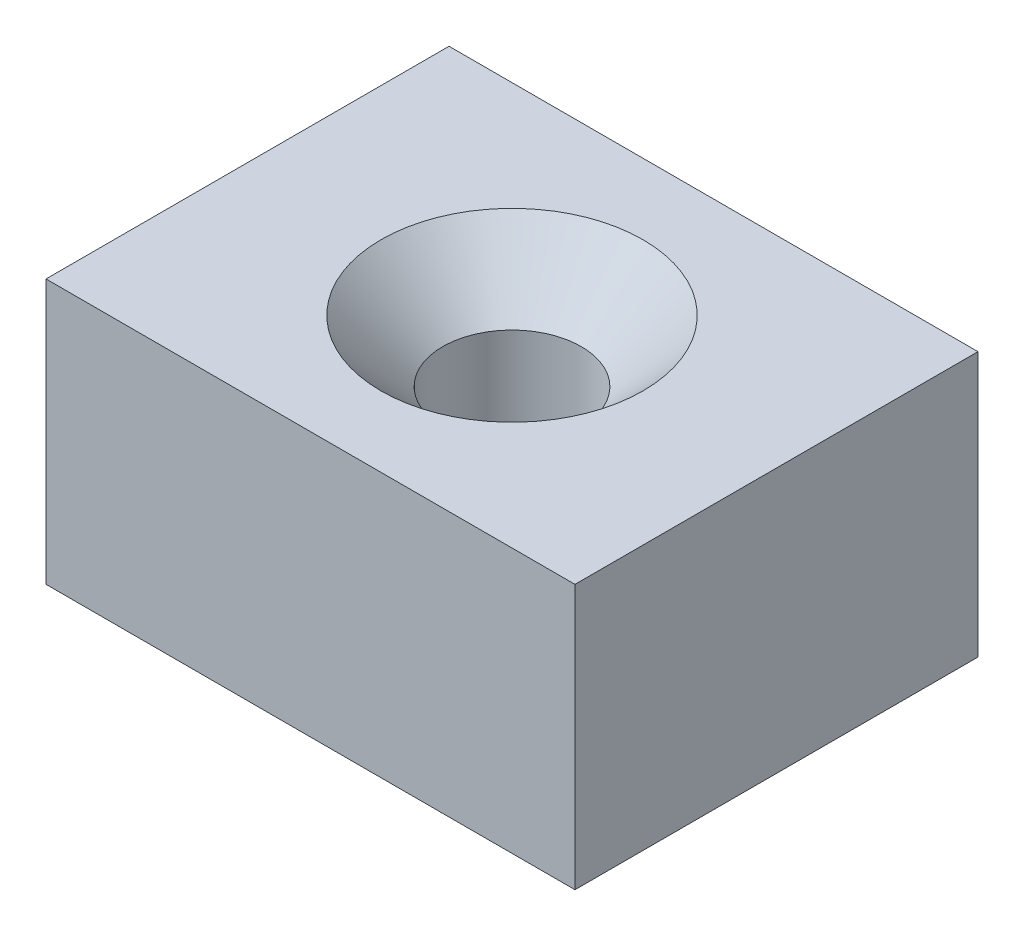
ISO-10303-21;
HEADER;
FILE_DESCRIPTION(('STEP AP214'),'2;1');
FILE_NAME('part.step','',(''),(''),'','','');
FILE_SCHEMA(('AUTOMOTIVE_DESIGN { 1 0 10303 214 1 1 1 1 }'));
ENDSEC;
DATA;
#1=APPLICATION_CONTEXT('core data for automotive mechanical design processes');
#2=APPLICATION_PROTOCOL_DEFINITION('international standard','automotive_design',2000,#1);
#3=PRODUCT_CONTEXT('',#1,'mechanical');
#4=PRODUCT('Part','Part','',(#3));
#5=PRODUCT_RELATED_PRODUCT_CATEGORY('part','',(#4));
#6=PRODUCT_DEFINITION_FORMATION('','',#4);
#7=PRODUCT_DEFINITION_CONTEXT('part definition',#1,'design');
#8=PRODUCT_DEFINITION('design','',#6,#7);
#9=PRODUCT_DEFINITION_SHAPE('','',#8);
#10=(LENGTH_UNIT() NAMED_UNIT(*) SI_UNIT(.MILLI.,.METRE.));
#11=(NAMED_UNIT(*) PLANE_ANGLE_UNIT() SI_UNIT($,.RADIAN.));
#12=(NAMED_UNIT(*) SI_UNIT($,.STERADIAN.) SOLID_ANGLE_UNIT());
#13=UNCERTAINTY_MEASURE_WITH_UNIT(LENGTH_MEASURE(1.E-05),#10,'distance_accuracy_value','');
#14=(GEOMETRIC_REPRESENTATION_CONTEXT(3) GLOBAL_UNCERTAINTY_ASSIGNED_CONTEXT((#13)) GLOBAL_UNIT_ASSIGNED_CONTEXT((#10,
#11,#12)) REPRESENTATION_CONTEXT('',''));
#15=CARTESIAN_POINT('',(0.,0.,0.));
#16=DIRECTION('',(0.,0.,1.));
#17=DIRECTION('',(1.,0.,0.));
#18=AXIS2_PLACEMENT_3D('',#15,#16,#17);
#19=CARTESIAN_POINT('',(10.5,5.25000000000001,16.));
#20=DIRECTION('',(-1.,0.,0.));
#21=DIRECTION('',(0.,-1.,0.));
#22=AXIS2_PLACEMENT_3D('',#19,#20,#21);
#23=PLANE('',#22);
#24=DIRECTION('',(0.,1.,0.));
#25=VECTOR('',#24,1.);
#26=CARTESIAN_POINT('',(10.5,5.25000000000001,0.));
#27=LINE('',#26,#25);
#28=CARTESIAN_POINT('',(10.5,-5.25,0.));
#29=VERTEX_POINT('',#28);
#30=CARTESIAN_POINT('',(10.5,5.25000000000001,0.));
#31=VERTEX_POINT('',#30);
#32=EDGE_CURVE('E95',#29,#31,#27,.T.);
#33=ORIENTED_EDGE('',*,*,#32,.T.);
#34=DIRECTION('',(0.,0.,-1.));
#35=VECTOR('',#34,1.);
#36=CARTESIAN_POINT('',(10.5,5.25000000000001,16.));
#37=LINE('',#36,#35);
#38=CARTESIAN_POINT('',(10.5,5.25000000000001,16.));
#39=VERTEX_POINT('',#38);
#40=EDGE_CURVE('E11',#39,#31,#37,.T.);
#41=ORIENTED_EDGE('',*,*,#40,.F.);
#42=DIRECTION('',(0.,1.,0.));
#43=VECTOR('',#42,1.);
#44=CARTESIAN_POINT('',(10.5,5.25000000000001,16.));
#45=LINE('',#44,#43);
#46=CARTESIAN_POINT('',(10.5,-5.25,16.));
#47=VERTEX_POINT('',#46);
#48=EDGE_CURVE('E83',#47,#39,#45,.T.);
#49=ORIENTED_EDGE('',*,*,#48,.F.);
#50=DIRECTION('',(0.,0.,-1.));
#51=VECTOR('',#50,1.);
#52=CARTESIAN_POINT('',(10.5,-5.25,16.));
#53=LINE('',#52,#51);
#54=EDGE_CURVE('E91',#47,#29,#53,.T.);
#55=ORIENTED_EDGE('',*,*,#54,.T.);
#56=EDGE_LOOP('',(#33,#41,#49,#55));
#57=FACE_BOUND('',#56,.T.);
#58=ADVANCED_FACE('F32',(#57),#23,.F.);
#59=CARTESIAN_POINT('',(-10.5,5.25000000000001,16.));
#60=DIRECTION('',(0.,-1.,0.));
#61=DIRECTION('',(0.,0.,-1.));
#62=AXIS2_PLACEMENT_3D('',#59,#60,#61);
#63=PLANE('',#62);
#64=CARTESIAN_POINT('',(0.,5.25000000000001,8.));
#65=DIRECTION('',(0.,1.,0.));
#66=DIRECTION('',(0.,0.,1.));
#67=AXIS2_PLACEMENT_3D('',#64,#65,#66);
#68=CIRCLE('',#67,5.2);
#69=CARTESIAN_POINT('',(0.,5.25000000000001,13.2));
#70=VERTEX_POINT('',#69);
#71=EDGE_CURVE('E114',#70,#70,#68,.T.);
#72=ORIENTED_EDGE('',*,*,#71,.F.);
#73=EDGE_LOOP('',(#72));
#74=FACE_BOUND('',#73,.T.);
#75=DIRECTION('',(-1.,0.,0.));
#76=VECTOR('',#75,1.);
#77=CARTESIAN_POINT('',(-10.5,5.25000000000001,0.));
#78=LINE('',#77,#76);
#79=CARTESIAN_POINT('',(-10.5,5.25000000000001,0.));
#80=VERTEX_POINT('',#79);
#81=EDGE_CURVE('E87',#31,#80,#78,.T.);
#82=ORIENTED_EDGE('',*,*,#81,.T.);
#83=DIRECTION('',(0.,0.,-1.));
#84=VECTOR('',#83,1.);
#85=CARTESIAN_POINT('',(-10.5,5.25000000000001,16.));
#86=LINE('',#85,#84);
#87=CARTESIAN_POINT('',(-10.5,5.25000000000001,16.));
#88=VERTEX_POINT('',#87);
#89=EDGE_CURVE('E40',#88,#80,#86,.T.);
#90=ORIENTED_EDGE('',*,*,#89,.F.);
#91=DIRECTION('',(-1.,0.,0.));
#92=VECTOR('',#91,1.);
#93=CARTESIAN_POINT('',(-10.5,5.25000000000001,16.));
#94=LINE('',#93,#92);
#95=EDGE_CURVE('E78',#39,#88,#94,.T.);
#96=ORIENTED_EDGE('',*,*,#95,.F.);
#97=ORIENTED_EDGE('',*,*,#40,.T.);
#98=EDGE_LOOP('',(#82,#90,#96,#97));
#99=FACE_BOUND('',#98,.T.);
#100=ADVANCED_FACE('F86',(#74,#99),#63,.F.);
#101=CARTESIAN_POINT('',(-10.5,5.25000000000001,16.));
#102=DIRECTION('',(1.,0.,0.));
#103=DIRECTION('',(0.,1.,0.));
#104=AXIS2_PLACEMENT_3D('',#101,#102,#103);
#105=PLANE('',#104);
#106=DIRECTION('',(0.,-1.,0.));
#107=VECTOR('',#106,1.);
#108=CARTESIAN_POINT('',(-10.5,5.25000000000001,0.));
#109=LINE('',#108,#107);
#110=CARTESIAN_POINT('',(-10.5,-5.25,0.));
#111=VERTEX_POINT('',#110);
#112=EDGE_CURVE('E65',#80,#111,#109,.T.);
#113=ORIENTED_EDGE('',*,*,#112,.T.);
#114=DIRECTION('',(0.,0.,-1.));
#115=VECTOR('',#114,1.);
#116=CARTESIAN_POINT('',(-10.5,-5.25,16.));
#117=LINE('',#116,#115);
#118=CARTESIAN_POINT('',(-10.5,-5.25,16.));
#119=VERTEX_POINT('',#118);
#120=EDGE_CURVE('E88',#119,#111,#117,.T.);
#121=ORIENTED_EDGE('',*,*,#120,.F.);
#122=DIRECTION('',(0.,-1.,0.));
#123=VECTOR('',#122,1.);
#124=CARTESIAN_POINT('',(-10.5,5.25000000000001,16.));
#125=LINE('',#124,#123);
#126=EDGE_CURVE('E81',#88,#119,#125,.T.);
#127=ORIENTED_EDGE('',*,*,#126,.F.);
#128=ORIENTED_EDGE('',*,*,#89,.T.);
#129=EDGE_LOOP('',(#113,#121,#127,#128));
#130=FACE_BOUND('',#129,.T.);
#131=ADVANCED_FACE('F89',(#130),#105,.F.);
#132=CARTESIAN_POINT('',(-10.5,-5.25,16.));
#133=DIRECTION('',(0.,1.,0.));
#134=DIRECTION('',(0.,0.,1.));
#135=AXIS2_PLACEMENT_3D('',#132,#133,#134);
#136=PLANE('',#135);
#137=CARTESIAN_POINT('',(0.,-5.25,8.));
#138=DIRECTION('',(0.,1.,0.));
#139=DIRECTION('',(0.,0.,1.));
#140=AXIS2_PLACEMENT_3D('',#137,#138,#139);
#141=CIRCLE('',#140,2.75);
#142=CARTESIAN_POINT('',(0.,-5.25,10.75));
#143=VERTEX_POINT('',#142);
#144=EDGE_CURVE('E98',#143,#143,#141,.T.);
#145=ORIENTED_EDGE('',*,*,#144,.T.);
#146=EDGE_LOOP('',(#145));
#147=FACE_BOUND('',#146,.T.);
#148=DIRECTION('',(1.,0.,0.));
#149=VECTOR('',#148,1.);
#150=CARTESIAN_POINT('',(-10.5,-5.25,0.));
#151=LINE('',#150,#149);
#152=EDGE_CURVE('E71',#111,#29,#151,.T.);
#153=ORIENTED_EDGE('',*,*,#152,.T.);
#154=ORIENTED_EDGE('',*,*,#54,.F.);
#155=DIRECTION('',(1.,0.,0.));
#156=VECTOR('',#155,1.);
#157=CARTESIAN_POINT('',(-10.5,-5.25,16.));
#158=LINE('',#157,#156);
#159=EDGE_CURVE('E48',#119,#47,#158,.T.);
#160=ORIENTED_EDGE('',*,*,#159,.F.);
#161=ORIENTED_EDGE('',*,*,#120,.T.);
#162=EDGE_LOOP('',(#153,#154,#160,#161));
#163=FACE_BOUND('',#162,.T.);
#164=ADVANCED_FACE('F103',(#147,#163),#136,.F.);
#165=CARTESIAN_POINT('',(0.,0.,16.));
#166=DIRECTION('',(0.,0.,1.));
#167=DIRECTION('',(1.,0.,0.));
#168=AXIS2_PLACEMENT_3D('',#165,#166,#167);
#169=PLANE('',#168);
#170=ORIENTED_EDGE('',*,*,#48,.T.);
#171=ORIENTED_EDGE('',*,*,#95,.T.);
#172=ORIENTED_EDGE('',*,*,#126,.T.);
#173=ORIENTED_EDGE('',*,*,#159,.T.);
#174=EDGE_LOOP('',(#170,#171,#172,#173));
#175=FACE_BOUND('',#174,.T.);
#176=ADVANCED_FACE('F79',(#175),#169,.T.);
#177=CARTESIAN_POINT('',(0.,0.,0.));
#178=DIRECTION('',(0.,0.,1.));
#179=DIRECTION('',(1.,0.,0.));
#180=AXIS2_PLACEMENT_3D('',#177,#178,#179);
#181=PLANE('',#180);
#182=ORIENTED_EDGE('',*,*,#32,.F.);
#183=ORIENTED_EDGE('',*,*,#152,.F.);
#184=ORIENTED_EDGE('',*,*,#112,.F.);
#185=ORIENTED_EDGE('',*,*,#81,.F.);
#186=EDGE_LOOP('',(#182,#183,#184,#185));
#187=FACE_BOUND('',#186,.T.);
#188=ADVANCED_FACE('F106',(#187),#181,.F.);
#189=CARTESIAN_POINT('',(0.,5.25000000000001,8.));
#190=DIRECTION('',(0.,1.,0.));
#191=DIRECTION('',(0.,0.,1.));
#192=AXIS2_PLACEMENT_3D('',#189,#190,#191);
#193=CYLINDRICAL_SURFACE('',#192,2.75);
#194=ORIENTED_EDGE('',*,*,#144,.F.);
#195=EDGE_LOOP('',(#194));
#196=FACE_BOUND('',#195,.T.);
#197=CARTESIAN_POINT('',(0.,2.80000000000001,8.));
#198=DIRECTION('',(0.,1.,0.));
#199=DIRECTION('',(0.,0.,1.));
#200=AXIS2_PLACEMENT_3D('',#197,#198,#199);
#201=CIRCLE('',#200,2.75);
#202=CARTESIAN_POINT('',(0.,2.80000000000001,10.75));
#203=VERTEX_POINT('',#202);
#204=EDGE_CURVE('E111',#203,#203,#201,.T.);
#205=ORIENTED_EDGE('',*,*,#204,.T.);
#206=EDGE_LOOP('',(#205));
#207=FACE_BOUND('',#206,.T.);
#208=ADVANCED_FACE('F132',(#196,#207),#193,.F.);
#209=CARTESIAN_POINT('',(0.,5.25000000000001,8.));
#210=DIRECTION('',(0.,1.,0.));
#211=DIRECTION('',(0.,0.,1.));
#212=AXIS2_PLACEMENT_3D('',#209,#210,#211);
#213=CONICAL_SURFACE('',#212,5.2,0.785398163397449);
#214=ORIENTED_EDGE('',*,*,#204,.F.);
#215=EDGE_LOOP('',(#214));
#216=FACE_BOUND('',#215,.T.);
#217=ORIENTED_EDGE('',*,*,#71,.T.);
#218=EDGE_LOOP('',(#217));
#219=FACE_BOUND('',#218,.T.);
#220=ADVANCED_FACE('F118',(#216,#219),#213,.F.);
#221=CLOSED_SHELL('',(#58,#100,#131,#164,#176,#188,#208,#220));
#222=MANIFOLD_SOLID_BREP('B2',#221);
#223=ADVANCED_BREP_SHAPE_REPRESENTATION('',(#18,#222),#14);
#224=SHAPE_DEFINITION_REPRESENTATION(#9,#223);
ENDSEC;
END-ISO-10303-21;
